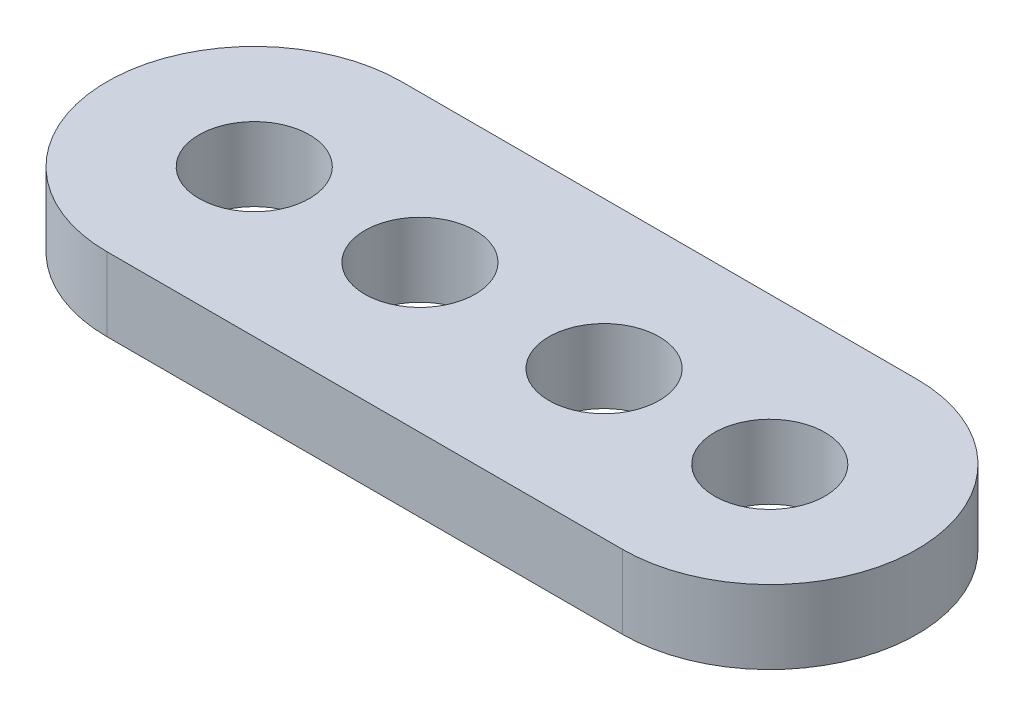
ISO-10303-21;
HEADER;
FILE_DESCRIPTION(('STEP AP214'),'2;1');
FILE_NAME('part.step','',(''),(''),'','','');
FILE_SCHEMA(('AUTOMOTIVE_DESIGN { 1 0 10303 214 1 1 1 1 }'));
ENDSEC;
DATA;
#1=APPLICATION_CONTEXT('core data for automotive mechanical design processes');
#2=APPLICATION_PROTOCOL_DEFINITION('international standard','automotive_design',2000,#1);
#3=PRODUCT_CONTEXT('',#1,'mechanical');
#4=PRODUCT('Part','Part','',(#3));
#5=PRODUCT_RELATED_PRODUCT_CATEGORY('part','',(#4));
#6=PRODUCT_DEFINITION_FORMATION('','',#4);
#7=PRODUCT_DEFINITION_CONTEXT('part definition',#1,'design');
#8=PRODUCT_DEFINITION('design','',#6,#7);
#9=PRODUCT_DEFINITION_SHAPE('','',#8);
#10=(LENGTH_UNIT() NAMED_UNIT(*) SI_UNIT(.MILLI.,.METRE.));
#11=(NAMED_UNIT(*) PLANE_ANGLE_UNIT() SI_UNIT($,.RADIAN.));
#12=(NAMED_UNIT(*) SI_UNIT($,.STERADIAN.) SOLID_ANGLE_UNIT());
#13=UNCERTAINTY_MEASURE_WITH_UNIT(LENGTH_MEASURE(1.E-05),#10,'distance_accuracy_value','');
#14=(GEOMETRIC_REPRESENTATION_CONTEXT(3) GLOBAL_UNCERTAINTY_ASSIGNED_CONTEXT((#13)) GLOBAL_UNIT_ASSIGNED_CONTEXT((#10,
#11,#12)) REPRESENTATION_CONTEXT('',''));
#15=CARTESIAN_POINT('',(0.,0.,0.));
#16=DIRECTION('',(0.,0.,1.));
#17=DIRECTION('',(1.,0.,0.));
#18=AXIS2_PLACEMENT_3D('',#15,#16,#17);
#19=CARTESIAN_POINT('',(0.,2.,0.));
#20=DIRECTION('',(0.,1.,0.));
#21=DIRECTION('',(0.,0.,1.));
#22=AXIS2_PLACEMENT_3D('',#19,#20,#21);
#23=PLANE('',#22);
#24=CARTESIAN_POINT('',(4.5,2.,0.));
#25=DIRECTION('',(0.,1.,0.));
#26=DIRECTION('',(0.,0.,1.));
#27=AXIS2_PLACEMENT_3D('',#24,#25,#26);
#28=CIRCLE('',#27,1.5);
#29=CARTESIAN_POINT('',(4.5,2.,1.5));
#30=VERTEX_POINT('',#29);
#31=EDGE_CURVE('E120',#30,#30,#28,.T.);
#32=ORIENTED_EDGE('',*,*,#31,.F.);
#33=EDGE_LOOP('',(#32));
#34=FACE_BOUND('',#33,.T.);
#35=CARTESIAN_POINT('',(0.,2.,0.));
#36=DIRECTION('',(0.,1.,0.));
#37=DIRECTION('',(0.,0.,1.));
#38=AXIS2_PLACEMENT_3D('',#35,#36,#37);
#39=CIRCLE('',#38,1.5);
#40=CARTESIAN_POINT('',(0.,2.,1.5));
#41=VERTEX_POINT('',#40);
#42=EDGE_CURVE('E99',#41,#41,#39,.T.);
#43=ORIENTED_EDGE('',*,*,#42,.F.);
#44=EDGE_LOOP('',(#43));
#45=FACE_BOUND('',#44,.T.);
#46=CARTESIAN_POINT('',(0.,2.,0.));
#47=DIRECTION('',(0.,1.,0.));
#48=DIRECTION('',(0.,0.,1.));
#49=AXIS2_PLACEMENT_3D('',#46,#47,#48);
#50=CIRCLE('',#49,4.);
#51=CARTESIAN_POINT('',(0.,2.,-4.));
#52=VERTEX_POINT('',#51);
#53=CARTESIAN_POINT('',(0.,2.,4.));
#54=VERTEX_POINT('',#53);
#55=EDGE_CURVE('E84',#52,#54,#50,.T.);
#56=ORIENTED_EDGE('',*,*,#55,.T.);
#57=DIRECTION('',(1.,0.,0.));
#58=VECTOR('',#57,1.);
#59=CARTESIAN_POINT('',(0.,2.,4.));
#60=LINE('',#59,#58);
#61=CARTESIAN_POINT('',(14.,2.,4.));
#62=VERTEX_POINT('',#61);
#63=EDGE_CURVE('E79',#54,#62,#60,.T.);
#64=ORIENTED_EDGE('',*,*,#63,.T.);
#65=CARTESIAN_POINT('',(14.,2.,0.));
#66=DIRECTION('',(0.,1.,0.));
#67=DIRECTION('',(0.,0.,1.));
#68=AXIS2_PLACEMENT_3D('',#65,#66,#67);
#69=CIRCLE('',#68,4.);
#70=CARTESIAN_POINT('',(14.,2.,-4.));
#71=VERTEX_POINT('',#70);
#72=EDGE_CURVE('E82',#62,#71,#69,.T.);
#73=ORIENTED_EDGE('',*,*,#72,.T.);
#74=DIRECTION('',(-1.,0.,0.));
#75=VECTOR('',#74,1.);
#76=CARTESIAN_POINT('',(0.,2.,-4.));
#77=LINE('',#76,#75);
#78=EDGE_CURVE('E49',#71,#52,#77,.T.);
#79=ORIENTED_EDGE('',*,*,#78,.T.);
#80=EDGE_LOOP('',(#56,#64,#73,#79));
#81=FACE_BOUND('',#80,.T.);
#82=CARTESIAN_POINT('',(14.,2.,0.));
#83=DIRECTION('',(0.,1.,0.));
#84=DIRECTION('',(0.,0.,1.));
#85=AXIS2_PLACEMENT_3D('',#82,#83,#84);
#86=CIRCLE('',#85,1.5);
#87=CARTESIAN_POINT('',(14.,2.,1.5));
#88=VERTEX_POINT('',#87);
#89=EDGE_CURVE('E114',#88,#88,#86,.T.);
#90=ORIENTED_EDGE('',*,*,#89,.F.);
#91=EDGE_LOOP('',(#90));
#92=FACE_BOUND('',#91,.T.);
#93=CARTESIAN_POINT('',(9.5,2.,0.));
#94=DIRECTION('',(0.,1.,0.));
#95=DIRECTION('',(0.,0.,1.));
#96=AXIS2_PLACEMENT_3D('',#93,#94,#95);
#97=CIRCLE('',#96,1.5);
#98=CARTESIAN_POINT('',(9.5,2.,1.5));
#99=VERTEX_POINT('',#98);
#100=EDGE_CURVE('E126',#99,#99,#97,.T.);
#101=ORIENTED_EDGE('',*,*,#100,.F.);
#102=EDGE_LOOP('',(#101));
#103=FACE_BOUND('',#102,.T.);
#104=ADVANCED_FACE('F32',(#34,#45,#81,#92,#103),#23,.T.);
#105=CARTESIAN_POINT('',(0.,0.,0.));
#106=DIRECTION('',(0.,1.,0.));
#107=DIRECTION('',(0.,0.,1.));
#108=AXIS2_PLACEMENT_3D('',#105,#106,#107);
#109=PLANE('',#108);
#110=CARTESIAN_POINT('',(0.,0.,0.));
#111=DIRECTION('',(0.,1.,0.));
#112=DIRECTION('',(0.,0.,1.));
#113=AXIS2_PLACEMENT_3D('',#110,#111,#112);
#114=CIRCLE('',#113,4.);
#115=CARTESIAN_POINT('',(0.,0.,-4.));
#116=VERTEX_POINT('',#115);
#117=CARTESIAN_POINT('',(0.,0.,4.));
#118=VERTEX_POINT('',#117);
#119=EDGE_CURVE('E96',#116,#118,#114,.T.);
#120=ORIENTED_EDGE('',*,*,#119,.F.);
#121=DIRECTION('',(-1.,0.,0.));
#122=VECTOR('',#121,1.);
#123=CARTESIAN_POINT('',(0.,0.,-4.));
#124=LINE('',#123,#122);
#125=CARTESIAN_POINT('',(14.,0.,-4.));
#126=VERTEX_POINT('',#125);
#127=EDGE_CURVE('E72',#126,#116,#124,.T.);
#128=ORIENTED_EDGE('',*,*,#127,.F.);
#129=CARTESIAN_POINT('',(14.,0.,0.));
#130=DIRECTION('',(0.,1.,0.));
#131=DIRECTION('',(0.,0.,1.));
#132=AXIS2_PLACEMENT_3D('',#129,#130,#131);
#133=CIRCLE('',#132,4.);
#134=CARTESIAN_POINT('',(14.,0.,4.));
#135=VERTEX_POINT('',#134);
#136=EDGE_CURVE('E66',#135,#126,#133,.T.);
#137=ORIENTED_EDGE('',*,*,#136,.F.);
#138=DIRECTION('',(1.,0.,0.));
#139=VECTOR('',#138,1.);
#140=CARTESIAN_POINT('',(0.,0.,4.));
#141=LINE('',#140,#139);
#142=EDGE_CURVE('E88',#118,#135,#141,.T.);
#143=ORIENTED_EDGE('',*,*,#142,.F.);
#144=EDGE_LOOP('',(#120,#128,#137,#143));
#145=FACE_BOUND('',#144,.T.);
#146=CARTESIAN_POINT('',(0.,0.,0.));
#147=DIRECTION('',(0.,1.,0.));
#148=DIRECTION('',(0.,0.,1.));
#149=AXIS2_PLACEMENT_3D('',#146,#147,#148);
#150=CIRCLE('',#149,1.5);
#151=CARTESIAN_POINT('',(0.,0.,1.5));
#152=VERTEX_POINT('',#151);
#153=EDGE_CURVE('E111',#152,#152,#150,.T.);
#154=ORIENTED_EDGE('',*,*,#153,.T.);
#155=EDGE_LOOP('',(#154));
#156=FACE_BOUND('',#155,.T.);
#157=CARTESIAN_POINT('',(14.,0.,0.));
#158=DIRECTION('',(0.,1.,0.));
#159=DIRECTION('',(0.,0.,1.));
#160=AXIS2_PLACEMENT_3D('',#157,#158,#159);
#161=CIRCLE('',#160,1.5);
#162=CARTESIAN_POINT('',(14.,0.,1.5));
#163=VERTEX_POINT('',#162);
#164=EDGE_CURVE('E117',#163,#163,#161,.T.);
#165=ORIENTED_EDGE('',*,*,#164,.T.);
#166=EDGE_LOOP('',(#165));
#167=FACE_BOUND('',#166,.T.);
#168=CARTESIAN_POINT('',(4.5,0.,0.));
#169=DIRECTION('',(0.,1.,0.));
#170=DIRECTION('',(0.,0.,1.));
#171=AXIS2_PLACEMENT_3D('',#168,#169,#170);
#172=CIRCLE('',#171,1.5);
#173=CARTESIAN_POINT('',(4.5,0.,1.5));
#174=VERTEX_POINT('',#173);
#175=EDGE_CURVE('E123',#174,#174,#172,.T.);
#176=ORIENTED_EDGE('',*,*,#175,.T.);
#177=EDGE_LOOP('',(#176));
#178=FACE_BOUND('',#177,.T.);
#179=CARTESIAN_POINT('',(9.5,0.,0.));
#180=DIRECTION('',(0.,1.,0.));
#181=DIRECTION('',(0.,0.,1.));
#182=AXIS2_PLACEMENT_3D('',#179,#180,#181);
#183=CIRCLE('',#182,1.5);
#184=CARTESIAN_POINT('',(9.5,0.,1.5));
#185=VERTEX_POINT('',#184);
#186=EDGE_CURVE('E129',#185,#185,#183,.T.);
#187=ORIENTED_EDGE('',*,*,#186,.T.);
#188=EDGE_LOOP('',(#187));
#189=FACE_BOUND('',#188,.T.);
#190=ADVANCED_FACE('F107',(#145,#156,#167,#178,#189),#109,.F.);
#191=CARTESIAN_POINT('',(0.,2.,0.));
#192=DIRECTION('',(0.,-1.,0.));
#193=DIRECTION('',(0.,0.,-1.));
#194=AXIS2_PLACEMENT_3D('',#191,#192,#193);
#195=CYLINDRICAL_SURFACE('',#194,4.);
#196=ORIENTED_EDGE('',*,*,#119,.T.);
#197=DIRECTION('',(0.,-1.,0.));
#198=VECTOR('',#197,1.);
#199=CARTESIAN_POINT('',(0.,2.,4.));
#200=LINE('',#199,#198);
#201=EDGE_CURVE('E11',#54,#118,#200,.T.);
#202=ORIENTED_EDGE('',*,*,#201,.F.);
#203=ORIENTED_EDGE('',*,*,#55,.F.);
#204=DIRECTION('',(0.,-1.,0.));
#205=VECTOR('',#204,1.);
#206=CARTESIAN_POINT('',(0.,2.,-4.));
#207=LINE('',#206,#205);
#208=EDGE_CURVE('E92',#52,#116,#207,.T.);
#209=ORIENTED_EDGE('',*,*,#208,.T.);
#210=EDGE_LOOP('',(#196,#202,#203,#209));
#211=FACE_BOUND('',#210,.T.);
#212=ADVANCED_FACE('F34',(#211),#195,.T.);
#213=CARTESIAN_POINT('',(0.,2.,4.));
#214=DIRECTION('',(0.,0.,-1.));
#215=DIRECTION('',(-1.,0.,0.));
#216=AXIS2_PLACEMENT_3D('',#213,#214,#215);
#217=PLANE('',#216);
#218=ORIENTED_EDGE('',*,*,#142,.T.);
#219=DIRECTION('',(0.,-1.,0.));
#220=VECTOR('',#219,1.);
#221=CARTESIAN_POINT('',(14.,2.,4.));
#222=LINE('',#221,#220);
#223=EDGE_CURVE('E41',#62,#135,#222,.T.);
#224=ORIENTED_EDGE('',*,*,#223,.F.);
#225=ORIENTED_EDGE('',*,*,#63,.F.);
#226=ORIENTED_EDGE('',*,*,#201,.T.);
#227=EDGE_LOOP('',(#218,#224,#225,#226));
#228=FACE_BOUND('',#227,.T.);
#229=ADVANCED_FACE('F87',(#228),#217,.F.);
#230=CARTESIAN_POINT('',(14.,2.,0.));
#231=DIRECTION('',(0.,-1.,0.));
#232=DIRECTION('',(0.,0.,-1.));
#233=AXIS2_PLACEMENT_3D('',#230,#231,#232);
#234=CYLINDRICAL_SURFACE('',#233,4.);
#235=ORIENTED_EDGE('',*,*,#136,.T.);
#236=DIRECTION('',(0.,-1.,0.));
#237=VECTOR('',#236,1.);
#238=CARTESIAN_POINT('',(14.,2.,-4.));
#239=LINE('',#238,#237);
#240=EDGE_CURVE('E89',#71,#126,#239,.T.);
#241=ORIENTED_EDGE('',*,*,#240,.F.);
#242=ORIENTED_EDGE('',*,*,#72,.F.);
#243=ORIENTED_EDGE('',*,*,#223,.T.);
#244=EDGE_LOOP('',(#235,#241,#242,#243));
#245=FACE_BOUND('',#244,.T.);
#246=ADVANCED_FACE('F90',(#245),#234,.T.);
#247=CARTESIAN_POINT('',(0.,2.,-4.));
#248=DIRECTION('',(0.,0.,1.));
#249=DIRECTION('',(1.,0.,0.));
#250=AXIS2_PLACEMENT_3D('',#247,#248,#249);
#251=PLANE('',#250);
#252=ORIENTED_EDGE('',*,*,#127,.T.);
#253=ORIENTED_EDGE('',*,*,#208,.F.);
#254=ORIENTED_EDGE('',*,*,#78,.F.);
#255=ORIENTED_EDGE('',*,*,#240,.T.);
#256=EDGE_LOOP('',(#252,#253,#254,#255));
#257=FACE_BOUND('',#256,.T.);
#258=ADVANCED_FACE('F104',(#257),#251,.F.);
#259=CARTESIAN_POINT('',(0.,2.,0.));
#260=DIRECTION('',(0.,-1.,0.));
#261=DIRECTION('',(0.,0.,-1.));
#262=AXIS2_PLACEMENT_3D('',#259,#260,#261);
#263=CYLINDRICAL_SURFACE('',#262,1.5);
#264=ORIENTED_EDGE('',*,*,#42,.T.);
#265=EDGE_LOOP('',(#264));
#266=FACE_BOUND('',#265,.T.);
#267=ORIENTED_EDGE('',*,*,#153,.F.);
#268=EDGE_LOOP('',(#267));
#269=FACE_BOUND('',#268,.T.);
#270=ADVANCED_FACE('F148',(#266,#269),#263,.F.);
#271=CARTESIAN_POINT('',(14.,2.,0.));
#272=DIRECTION('',(0.,-1.,0.));
#273=DIRECTION('',(0.,0.,-1.));
#274=AXIS2_PLACEMENT_3D('',#271,#272,#273);
#275=CYLINDRICAL_SURFACE('',#274,1.5);
#276=ORIENTED_EDGE('',*,*,#89,.T.);
#277=EDGE_LOOP('',(#276));
#278=FACE_BOUND('',#277,.T.);
#279=ORIENTED_EDGE('',*,*,#164,.F.);
#280=EDGE_LOOP('',(#279));
#281=FACE_BOUND('',#280,.T.);
#282=ADVANCED_FACE('F194',(#278,#281),#275,.F.);
#283=CARTESIAN_POINT('',(4.5,2.,0.));
#284=DIRECTION('',(0.,-1.,0.));
#285=DIRECTION('',(0.,0.,-1.));
#286=AXIS2_PLACEMENT_3D('',#283,#284,#285);
#287=CYLINDRICAL_SURFACE('',#286,1.5);
#288=ORIENTED_EDGE('',*,*,#31,.T.);
#289=EDGE_LOOP('',(#288));
#290=FACE_BOUND('',#289,.T.);
#291=ORIENTED_EDGE('',*,*,#175,.F.);
#292=EDGE_LOOP('',(#291));
#293=FACE_BOUND('',#292,.T.);
#294=ADVANCED_FACE('F202',(#290,#293),#287,.F.);
#295=CARTESIAN_POINT('',(9.5,2.,0.));
#296=DIRECTION('',(0.,-1.,0.));
#297=DIRECTION('',(0.,0.,-1.));
#298=AXIS2_PLACEMENT_3D('',#295,#296,#297);
#299=CYLINDRICAL_SURFACE('',#298,1.5);
#300=ORIENTED_EDGE('',*,*,#100,.T.);
#301=EDGE_LOOP('',(#300));
#302=FACE_BOUND('',#301,.T.);
#303=ORIENTED_EDGE('',*,*,#186,.F.);
#304=EDGE_LOOP('',(#303));
#305=FACE_BOUND('',#304,.T.);
#306=ADVANCED_FACE('F135',(#302,#305),#299,.F.);
#307=CLOSED_SHELL('',(#104,#190,#212,#229,#246,#258,#270,#282,#294,#306));
#308=MANIFOLD_SOLID_BREP('B2',#307);
#309=ADVANCED_BREP_SHAPE_REPRESENTATION('',(#18,#308),#14);
#310=SHAPE_DEFINITION_REPRESENTATION(#9,#309);
ENDSEC;
END-ISO-10303-21;
